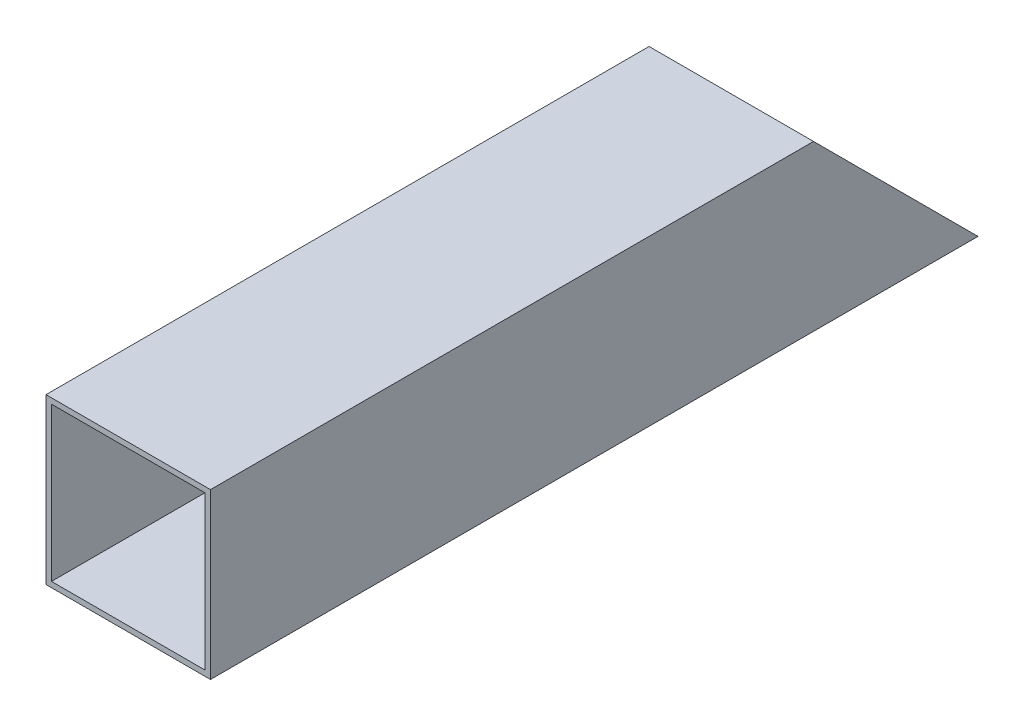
from build123d import *

# Parameters (mm, degrees)
SCHIZZO1_W                = 30
SCHIZZO1_H                = 30
SCHIZZO1_W_2              = 28
SCHIZZO1_H_2              = 28
ESTRUSIONE_SOTTILE1_DEPTH = 140
TAGLIO_ESTRUSIONE1_REACH  = 145.962


with BuildPart() as part:
    # Schizzo1 → Estrusione-Sottile1 (new body)
    with BuildSketch(Plane.XY):
        Rectangle(SCHIZZO1_W, SCHIZZO1_H)
        Rectangle(SCHIZZO1_W_2, SCHIZZO1_H_2, mode=Mode.SUBTRACT)
    extrude(amount=ESTRUSIONE_SOTTILE1_DEPTH)

    # Schizzo3 → Taglio-Estrusione1 (cut, up to next)
    with BuildSketch(Plane.ZY.offset(15), mode=Mode.PRIVATE) as taglio_estrusione1_sk1:
        Polygon((0, -15), (30, 15), (0, 15), align=None)
    taglio_estrusione1_tool1 = extrude(taglio_estrusione1_sk1.sketch, amount=-TAGLIO_ESTRUSIONE1_REACH, mode=Mode.PRIVATE) & part.part
    add(taglio_estrusione1_tool1.solids().sort_by_distance((-15, 5, 10))[0], mode=Mode.SUBTRACT)


solid = part.part
